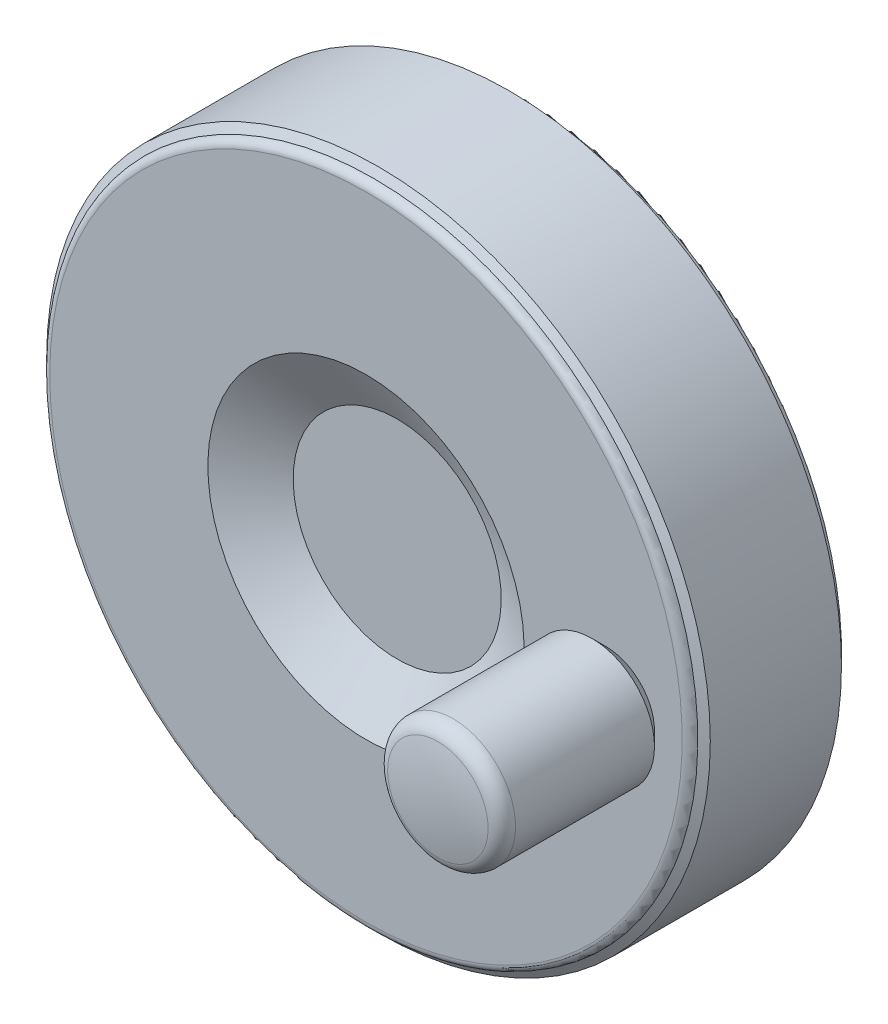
ISO-10303-21;
HEADER;
FILE_DESCRIPTION(('STEP AP214'),'2;1');
FILE_NAME('part.step','',(''),(''),'','','');
FILE_SCHEMA(('AUTOMOTIVE_DESIGN { 1 0 10303 214 1 1 1 1 }'));
ENDSEC;
DATA;
#1=APPLICATION_CONTEXT('core data for automotive mechanical design processes');
#2=APPLICATION_PROTOCOL_DEFINITION('international standard','automotive_design',2000,#1);
#3=PRODUCT_CONTEXT('',#1,'mechanical');
#4=PRODUCT('Part','Part','',(#3));
#5=PRODUCT_RELATED_PRODUCT_CATEGORY('part','',(#4));
#6=PRODUCT_DEFINITION_FORMATION('','',#4);
#7=PRODUCT_DEFINITION_CONTEXT('part definition',#1,'design');
#8=PRODUCT_DEFINITION('design','',#6,#7);
#9=PRODUCT_DEFINITION_SHAPE('','',#8);
#10=(LENGTH_UNIT() NAMED_UNIT(*) SI_UNIT(.MILLI.,.METRE.));
#11=(NAMED_UNIT(*) PLANE_ANGLE_UNIT() SI_UNIT($,.RADIAN.));
#12=(NAMED_UNIT(*) SI_UNIT($,.STERADIAN.) SOLID_ANGLE_UNIT());
#13=UNCERTAINTY_MEASURE_WITH_UNIT(LENGTH_MEASURE(1.E-05),#10,'distance_accuracy_value','');
#14=(GEOMETRIC_REPRESENTATION_CONTEXT(3) GLOBAL_UNCERTAINTY_ASSIGNED_CONTEXT((#13)) GLOBAL_UNIT_ASSIGNED_CONTEXT((#10,
#11,#12)) REPRESENTATION_CONTEXT('',''));
#15=CARTESIAN_POINT('',(0.,0.,0.));
#16=DIRECTION('',(0.,0.,1.));
#17=DIRECTION('',(1.,0.,0.));
#18=AXIS2_PLACEMENT_3D('',#15,#16,#17);
#19=CARTESIAN_POINT('',(-14.5,0.,7.44337567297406));
#20=DIRECTION('',(0.,0.5,0.866025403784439));
#21=DIRECTION('',(0.,0.866025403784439,-0.5));
#22=AXIS2_PLACEMENT_3D('',#19,#20,#21);
#23=PLANE('',#22);
#24=DIRECTION('',(-1.,0.,0.));
#25=VECTOR('',#24,1.);
#26=CARTESIAN_POINT('',(-14.5,0.,7.44337567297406));
#27=LINE('',#26,#25);
#28=CARTESIAN_POINT('',(-11.3333333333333,0.,7.44337567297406));
#29=VERTEX_POINT('',#28);
#30=CARTESIAN_POINT('',(-14.5,0.,7.44337567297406));
#31=VERTEX_POINT('',#30);
#32=EDGE_CURVE('E98',#29,#31,#27,.T.);
#33=ORIENTED_EDGE('',*,*,#32,.T.);
#34=DIRECTION('',(0.,0.866025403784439,-0.5));
#35=VECTOR('',#34,1.);
#36=CARTESIAN_POINT('',(-14.5,0.,7.44337567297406));
#37=LINE('',#36,#35);
#38=CARTESIAN_POINT('',(-14.5,1.25,6.72168783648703));
#39=VERTEX_POINT('',#38);
#40=EDGE_CURVE('E87',#39,#31,#37,.F.);
#41=ORIENTED_EDGE('',*,*,#40,.F.);
#42=DIRECTION('',(-1.,0.,0.));
#43=VECTOR('',#42,1.);
#44=CARTESIAN_POINT('',(-14.5,1.25,6.72168783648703));
#45=LINE('',#44,#43);
#46=CARTESIAN_POINT('',(-11.3333333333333,1.25,6.72168783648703));
#47=VERTEX_POINT('',#46);
#48=EDGE_CURVE('E302',#39,#47,#45,.F.);
#49=ORIENTED_EDGE('',*,*,#48,.T.);
#50=DIRECTION('',(0.,0.866025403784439,-0.5));
#51=VECTOR('',#50,1.);
#52=CARTESIAN_POINT('',(-11.3333333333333,0.,7.44337567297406));
#53=LINE('',#52,#51);
#54=EDGE_CURVE('E82',#29,#47,#53,.T.);
#55=ORIENTED_EDGE('',*,*,#54,.F.);
#56=EDGE_LOOP('',(#33,#41,#49,#55));
#57=FACE_BOUND('',#56,.T.);
#58=ADVANCED_FACE('F15',(#57),#23,.F.);
#59=CARTESIAN_POINT('',(-14.5,-1.25,6.72168783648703));
#60=DIRECTION('',(0.,-0.5,0.866025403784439));
#61=DIRECTION('',(0.,0.866025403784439,0.5));
#62=AXIS2_PLACEMENT_3D('',#59,#60,#61);
#63=PLANE('',#62);
#64=DIRECTION('',(1.,0.,0.));
#65=VECTOR('',#64,1.);
#66=CARTESIAN_POINT('',(-14.5,-1.25,6.72168783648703));
#67=LINE('',#66,#65);
#68=CARTESIAN_POINT('',(-11.3333333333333,-1.25,6.72168783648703));
#69=VERTEX_POINT('',#68);
#70=CARTESIAN_POINT('',(-14.5,-1.25,6.72168783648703));
#71=VERTEX_POINT('',#70);
#72=EDGE_CURVE('E103',#69,#71,#67,.F.);
#73=ORIENTED_EDGE('',*,*,#72,.T.);
#74=DIRECTION('',(0.,0.866025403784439,0.5));
#75=VECTOR('',#74,1.);
#76=CARTESIAN_POINT('',(-14.5,-1.25,6.72168783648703));
#77=LINE('',#76,#75);
#78=EDGE_CURVE('E90',#31,#71,#77,.F.);
#79=ORIENTED_EDGE('',*,*,#78,.F.);
#80=ORIENTED_EDGE('',*,*,#32,.F.);
#81=DIRECTION('',(0.,0.866025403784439,0.5));
#82=VECTOR('',#81,1.);
#83=CARTESIAN_POINT('',(-11.3333333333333,-1.25,6.72168783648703));
#84=LINE('',#83,#82);
#85=EDGE_CURVE('E105',#69,#29,#84,.T.);
#86=ORIENTED_EDGE('',*,*,#85,.F.);
#87=EDGE_LOOP('',(#73,#79,#80,#86));
#88=FACE_BOUND('',#87,.T.);
#89=ADVANCED_FACE('F101',(#88),#63,.F.);
#90=CARTESIAN_POINT('',(-14.5,1.25,6.72168783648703));
#91=DIRECTION('',(0.,1.,0.));
#92=DIRECTION('',(-1.,0.,0.));
#93=AXIS2_PLACEMENT_3D('',#90,#91,#92);
#94=PLANE('',#93);
#95=ORIENTED_EDGE('',*,*,#48,.F.);
#96=DIRECTION('',(0.,0.,1.));
#97=VECTOR('',#96,1.);
#98=CARTESIAN_POINT('',(-14.5,1.25,6.72168783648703));
#99=LINE('',#98,#97);
#100=CARTESIAN_POINT('',(-14.5,1.25,5.27831216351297));
#101=VERTEX_POINT('',#100);
#102=EDGE_CURVE('E93',#101,#39,#99,.T.);
#103=ORIENTED_EDGE('',*,*,#102,.F.);
#104=DIRECTION('',(-1.,0.,0.));
#105=VECTOR('',#104,1.);
#106=CARTESIAN_POINT('',(-14.5,1.25,5.27831216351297));
#107=LINE('',#106,#105);
#108=CARTESIAN_POINT('',(-11.3333333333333,1.25,5.27831216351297));
#109=VERTEX_POINT('',#108);
#110=EDGE_CURVE('E292',#101,#109,#107,.F.);
#111=ORIENTED_EDGE('',*,*,#110,.T.);
#112=DIRECTION('',(0.,0.,1.));
#113=VECTOR('',#112,1.);
#114=CARTESIAN_POINT('',(-11.3333333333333,1.25,6.72168783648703));
#115=LINE('',#114,#113);
#116=EDGE_CURVE('E300',#47,#109,#115,.F.);
#117=ORIENTED_EDGE('',*,*,#116,.F.);
#118=EDGE_LOOP('',(#95,#103,#111,#117));
#119=FACE_BOUND('',#118,.T.);
#120=ADVANCED_FACE('F305',(#119),#94,.F.);
#121=CARTESIAN_POINT('',(-14.5,-1.25,5.27831216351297));
#122=DIRECTION('',(0.,-1.,0.));
#123=DIRECTION('',(1.,0.,0.));
#124=AXIS2_PLACEMENT_3D('',#121,#122,#123);
#125=PLANE('',#124);
#126=DIRECTION('',(-1.,0.,0.));
#127=VECTOR('',#126,1.);
#128=CARTESIAN_POINT('',(-14.5,-1.25,5.27831216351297));
#129=LINE('',#128,#127);
#130=CARTESIAN_POINT('',(-11.3333333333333,-1.25,5.27831216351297));
#131=VERTEX_POINT('',#130);
#132=CARTESIAN_POINT('',(-14.5,-1.25,5.27831216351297));
#133=VERTEX_POINT('',#132);
#134=EDGE_CURVE('E283',#131,#133,#129,.T.);
#135=ORIENTED_EDGE('',*,*,#134,.T.);
#136=DIRECTION('',(0.,0.,1.));
#137=VECTOR('',#136,1.);
#138=CARTESIAN_POINT('',(-14.5,-1.25,5.27831216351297));
#139=LINE('',#138,#137);
#140=EDGE_CURVE('E297',#71,#133,#139,.F.);
#141=ORIENTED_EDGE('',*,*,#140,.F.);
#142=ORIENTED_EDGE('',*,*,#72,.F.);
#143=DIRECTION('',(0.,0.,1.));
#144=VECTOR('',#143,1.);
#145=CARTESIAN_POINT('',(-11.3333333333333,-1.25,0.));
#146=LINE('',#145,#144);
#147=EDGE_CURVE('E286',#131,#69,#146,.T.);
#148=ORIENTED_EDGE('',*,*,#147,.F.);
#149=EDGE_LOOP('',(#135,#141,#142,#148));
#150=FACE_BOUND('',#149,.T.);
#151=ADVANCED_FACE('F312',(#150),#125,.F.);
#152=CARTESIAN_POINT('',(-14.5,1.25,5.27831216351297));
#153=DIRECTION('',(0.,0.5,-0.866025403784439));
#154=DIRECTION('',(0.,-0.866025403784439,-0.5));
#155=AXIS2_PLACEMENT_3D('',#152,#153,#154);
#156=PLANE('',#155);
#157=ORIENTED_EDGE('',*,*,#110,.F.);
#158=DIRECTION('',(0.,-0.866025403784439,-0.5));
#159=VECTOR('',#158,1.);
#160=CARTESIAN_POINT('',(-14.5,1.25,5.27831216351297));
#161=LINE('',#160,#159);
#162=CARTESIAN_POINT('',(-14.5,0.,4.55662432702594));
#163=VERTEX_POINT('',#162);
#164=EDGE_CURVE('E295',#163,#101,#161,.F.);
#165=ORIENTED_EDGE('',*,*,#164,.F.);
#166=DIRECTION('',(-1.,0.,0.));
#167=VECTOR('',#166,1.);
#168=CARTESIAN_POINT('',(-14.5,0.,4.55662432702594));
#169=LINE('',#168,#167);
#170=CARTESIAN_POINT('',(-11.3333333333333,0.,4.55662432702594));
#171=VERTEX_POINT('',#170);
#172=EDGE_CURVE('E281',#163,#171,#169,.F.);
#173=ORIENTED_EDGE('',*,*,#172,.T.);
#174=DIRECTION('',(0.,-0.866025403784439,-0.5));
#175=VECTOR('',#174,1.);
#176=CARTESIAN_POINT('',(-11.3333333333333,1.25,5.27831216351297));
#177=LINE('',#176,#175);
#178=EDGE_CURVE('E289',#109,#171,#177,.T.);
#179=ORIENTED_EDGE('',*,*,#178,.F.);
#180=EDGE_LOOP('',(#157,#165,#173,#179));
#181=FACE_BOUND('',#180,.T.);
#182=ADVANCED_FACE('F319',(#181),#156,.F.);
#183=CARTESIAN_POINT('',(-11.3333333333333,0.,0.));
#184=DIRECTION('',(-1.,0.,0.));
#185=DIRECTION('',(0.,-1.,0.));
#186=AXIS2_PLACEMENT_3D('',#183,#184,#185);
#187=PLANE('',#186);
#188=ORIENTED_EDGE('',*,*,#54,.T.);
#189=ORIENTED_EDGE('',*,*,#116,.T.);
#190=ORIENTED_EDGE('',*,*,#178,.T.);
#191=DIRECTION('',(0.,-0.866025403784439,0.5));
#192=VECTOR('',#191,1.);
#193=CARTESIAN_POINT('',(-11.3333333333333,0.,4.55662432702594));
#194=LINE('',#193,#192);
#195=EDGE_CURVE('E278',#171,#131,#194,.T.);
#196=ORIENTED_EDGE('',*,*,#195,.T.);
#197=ORIENTED_EDGE('',*,*,#147,.T.);
#198=ORIENTED_EDGE('',*,*,#85,.T.);
#199=EDGE_LOOP('',(#188,#189,#190,#196,#197,#198));
#200=FACE_BOUND('',#199,.T.);
#201=ADVANCED_FACE('F309',(#200),#187,.T.);
#202=CARTESIAN_POINT('',(-14.5,0.,4.55662432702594));
#203=DIRECTION('',(0.,-0.5,-0.866025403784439));
#204=DIRECTION('',(0.,-0.866025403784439,0.5));
#205=AXIS2_PLACEMENT_3D('',#202,#203,#204);
#206=PLANE('',#205);
#207=ORIENTED_EDGE('',*,*,#172,.F.);
#208=DIRECTION('',(0.,0.866025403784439,-0.5));
#209=VECTOR('',#208,1.);
#210=CARTESIAN_POINT('',(-14.5,-1.25,5.27831216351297));
#211=LINE('',#210,#209);
#212=EDGE_CURVE('E274',#133,#163,#211,.T.);
#213=ORIENTED_EDGE('',*,*,#212,.F.);
#214=ORIENTED_EDGE('',*,*,#134,.F.);
#215=ORIENTED_EDGE('',*,*,#195,.F.);
#216=EDGE_LOOP('',(#207,#213,#214,#215));
#217=FACE_BOUND('',#216,.T.);
#218=ADVANCED_FACE('F317',(#217),#206,.F.);
#219=CARTESIAN_POINT('',(-14.5,0.,7.00475));
#220=DIRECTION('',(-1.,0.,0.));
#221=DIRECTION('',(0.,-1.,0.));
#222=AXIS2_PLACEMENT_3D('',#219,#220,#221);
#223=PLANE('',#222);
#224=CARTESIAN_POINT('',(-14.4999999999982,0.,6.));
#225=DIRECTION('',(1.,0.,0.));
#226=DIRECTION('',(0.,1.,0.));
#227=AXIS2_PLACEMENT_3D('',#224,#225,#226);
#228=CIRCLE('',#227,2.00950000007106);
#229=CARTESIAN_POINT('',(-14.4999999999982,2.00950000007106,6.));
#230=VERTEX_POINT('',#229);
#231=EDGE_CURVE('E277',#230,#230,#228,.T.);
#232=ORIENTED_EDGE('',*,*,#231,.F.);
#233=EDGE_LOOP('',(#232));
#234=FACE_BOUND('',#233,.T.);
#235=ORIENTED_EDGE('',*,*,#140,.T.);
#236=ORIENTED_EDGE('',*,*,#212,.T.);
#237=ORIENTED_EDGE('',*,*,#164,.T.);
#238=ORIENTED_EDGE('',*,*,#102,.T.);
#239=ORIENTED_EDGE('',*,*,#40,.T.);
#240=ORIENTED_EDGE('',*,*,#78,.T.);
#241=EDGE_LOOP('',(#235,#236,#237,#238,#239,#240));
#242=FACE_BOUND('',#241,.T.);
#243=ADVANCED_FACE('F88',(#234,#242),#223,.T.);
#244=CARTESIAN_POINT('',(0.,0.,11.5));
#245=DIRECTION('',(0.,0.,-1.));
#246=DIRECTION('',(-1.,0.,0.));
#247=AXIS2_PLACEMENT_3D('',#244,#245,#246);
#248=CYLINDRICAL_SURFACE('',#247,5.00000000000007);
#249=CARTESIAN_POINT('',(0.,0.,22.));
#250=DIRECTION('',(0.,0.,-1.));
#251=DIRECTION('',(0.,-1.,0.));
#252=AXIS2_PLACEMENT_3D('',#249,#250,#251);
#253=CIRCLE('',#252,5.00000000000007);
#254=CARTESIAN_POINT('',(0.,-5.00000000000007,22.));
#255=VERTEX_POINT('',#254);
#256=EDGE_CURVE('E95',#255,#255,#253,.T.);
#257=ORIENTED_EDGE('',*,*,#256,.F.);
#258=EDGE_LOOP('',(#257));
#259=FACE_BOUND('',#258,.T.);
#260=CARTESIAN_POINT('',(0.,0.,0.));
#261=DIRECTION('',(0.,0.,-1.));
#262=DIRECTION('',(-1.,0.,0.));
#263=AXIS2_PLACEMENT_3D('',#260,#261,#262);
#264=CIRCLE('',#263,5.00000000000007);
#265=CARTESIAN_POINT('',(-5.00000000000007,0.,0.));
#266=VERTEX_POINT('',#265);
#267=EDGE_CURVE('E273',#266,#266,#264,.F.);
#268=ORIENTED_EDGE('',*,*,#267,.F.);
#269=EDGE_LOOP('',(#268));
#270=FACE_BOUND('',#269,.T.);
#271=ADVANCED_FACE('F365',(#259,#270),#248,.F.);
#272=CARTESIAN_POINT('',(-14.0095000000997,0.,6.));
#273=DIRECTION('',(1.,0.,0.));
#274=DIRECTION('',(0.,1.,0.));
#275=AXIS2_PLACEMENT_3D('',#272,#273,#274);
#276=CONICAL_SURFACE('',#275,2.49999999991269,0.785398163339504);
#277=CARTESIAN_POINT('',(-14.0095,0.,6.));
#278=DIRECTION('',(-1.,0.,0.));
#279=DIRECTION('',(0.,-1.,0.));
#280=AXIS2_PLACEMENT_3D('',#277,#278,#279);
#281=CIRCLE('',#280,2.5);
#282=CARTESIAN_POINT('',(-14.0095,-2.5,6.));
#283=VERTEX_POINT('',#282);
#284=EDGE_CURVE('E270',#283,#283,#281,.F.);
#285=ORIENTED_EDGE('',*,*,#284,.F.);
#286=EDGE_LOOP('',(#285));
#287=FACE_BOUND('',#286,.T.);
#288=ORIENTED_EDGE('',*,*,#231,.T.);
#289=EDGE_LOOP('',(#288));
#290=FACE_BOUND('',#289,.T.);
#291=ADVANCED_FACE('F375',(#287,#290),#276,.T.);
#292=CARTESIAN_POINT('',(-6.5,0.,0.));
#293=DIRECTION('',(0.,0.,-1.));
#294=DIRECTION('',(-1.,0.,0.));
#295=AXIS2_PLACEMENT_3D('',#292,#293,#294);
#296=PLANE('',#295);
#297=ORIENTED_EDGE('',*,*,#267,.T.);
#298=EDGE_LOOP('',(#297));
#299=FACE_BOUND('',#298,.T.);
#300=CARTESIAN_POINT('',(0.,0.,0.));
#301=DIRECTION('',(0.,0.,-1.));
#302=DIRECTION('',(-1.,0.,0.));
#303=AXIS2_PLACEMENT_3D('',#300,#301,#302);
#304=CIRCLE('',#303,8.);
#305=CARTESIAN_POINT('',(-8.,0.,0.));
#306=VERTEX_POINT('',#305);
#307=EDGE_CURVE('E269',#306,#306,#304,.F.);
#308=ORIENTED_EDGE('',*,*,#307,.F.);
#309=EDGE_LOOP('',(#308));
#310=FACE_BOUND('',#309,.T.);
#311=ADVANCED_FACE('F385',(#299,#310),#296,.T.);
#312=CARTESIAN_POINT('',(-9.75,0.,6.));
#313=DIRECTION('',(-1.,0.,0.));
#314=DIRECTION('',(0.,-1.,0.));
#315=AXIS2_PLACEMENT_3D('',#312,#313,#314);
#316=CYLINDRICAL_SURFACE('',#315,2.5);
#317=CARTESIAN_POINT('',(-7.99999999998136,0.,6.));
#318=DIRECTION('',(-1.,0.,0.));
#319=DIRECTION('',(0.,0.,1.));
#320=AXIS2_PLACEMENT_3D('',#317,#318,#319);
#321=CIRCLE('',#320,2.49999999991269);
#322=CARTESIAN_POINT('',(-7.99999999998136,0.,8.49999999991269));
#323=VERTEX_POINT('',#322);
#324=EDGE_CURVE('E266',#323,#323,#321,.T.);
#325=ORIENTED_EDGE('',*,*,#324,.T.);
#326=EDGE_LOOP('',(#325));
#327=FACE_BOUND('',#326,.T.);
#328=ORIENTED_EDGE('',*,*,#284,.T.);
#329=EDGE_LOOP('',(#328));
#330=FACE_BOUND('',#329,.T.);
#331=ADVANCED_FACE('F395',(#327,#330),#316,.T.);
#332=CARTESIAN_POINT('',(0.,0.,0.15));
#333=DIRECTION('',(0.,0.,-1.));
#334=DIRECTION('',(-1.,0.,0.));
#335=AXIS2_PLACEMENT_3D('',#332,#333,#334);
#336=CYLINDRICAL_SURFACE('',#335,8.);
#337=CARTESIAN_POINT('',(0.,0.,0.3));
#338=DIRECTION('',(0.,0.,-1.));
#339=DIRECTION('',(-1.,0.,0.));
#340=AXIS2_PLACEMENT_3D('',#337,#338,#339);
#341=CIRCLE('',#340,8.);
#342=CARTESIAN_POINT('',(-8.,0.,0.3));
#343=VERTEX_POINT('',#342);
#344=EDGE_CURVE('E265',#343,#343,#341,.F.);
#345=ORIENTED_EDGE('',*,*,#344,.F.);
#346=EDGE_LOOP('',(#345));
#347=FACE_BOUND('',#346,.T.);
#348=ORIENTED_EDGE('',*,*,#307,.T.);
#349=EDGE_LOOP('',(#348));
#350=FACE_BOUND('',#349,.T.);
#351=ADVANCED_FACE('F405',(#347,#350),#336,.T.);
#352=CARTESIAN_POINT('',(-8.27777777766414,0.,6.));
#353=DIRECTION('',(-1.,0.,0.));
#354=DIRECTION('',(0.,-1.,0.));
#355=AXIS2_PLACEMENT_3D('',#352,#353,#354);
#356=CONICAL_SURFACE('',#355,2.77777777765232,0.785398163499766);
#357=CARTESIAN_POINT('',(-8.27777777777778,0.,6.));
#358=DIRECTION('',(-1.,0.,0.));
#359=DIRECTION('',(0.,-1.,0.));
#360=AXIS2_PLACEMENT_3D('',#357,#358,#359);
#361=CIRCLE('',#360,2.77777777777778);
#362=CARTESIAN_POINT('',(-8.27777777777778,-2.77777777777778,6.));
#363=VERTEX_POINT('',#362);
#364=EDGE_CURVE('E262',#363,#363,#361,.T.);
#365=ORIENTED_EDGE('',*,*,#364,.T.);
#366=EDGE_LOOP('',(#365));
#367=FACE_BOUND('',#366,.T.);
#368=ORIENTED_EDGE('',*,*,#324,.F.);
#369=EDGE_LOOP('',(#368));
#370=FACE_BOUND('',#369,.T.);
#371=ADVANCED_FACE('F415',(#367,#370),#356,.F.);
#372=CARTESIAN_POINT('',(-10.5,0.,0.3));
#373=DIRECTION('',(0.,0.,-1.));
#374=DIRECTION('',(-1.,0.,0.));
#375=AXIS2_PLACEMENT_3D('',#372,#373,#374);
#376=PLANE('',#375);
#377=ORIENTED_EDGE('',*,*,#344,.T.);
#378=EDGE_LOOP('',(#377));
#379=FACE_BOUND('',#378,.T.);
#380=CARTESIAN_POINT('',(0.,0.,0.3));
#381=DIRECTION('',(0.,0.,1.));
#382=DIRECTION('',(1.,0.,0.));
#383=AXIS2_PLACEMENT_3D('',#380,#381,#382);
#384=CIRCLE('',#383,13.);
#385=CARTESIAN_POINT('',(13.,0.,0.3));
#386=VERTEX_POINT('',#385);
#387=EDGE_CURVE('E156',#386,#386,#384,.T.);
#388=ORIENTED_EDGE('',*,*,#387,.F.);
#389=EDGE_LOOP('',(#388));
#390=FACE_BOUND('',#389,.T.);
#391=ADVANCED_FACE('F177',(#379,#390),#376,.T.);
#392=CARTESIAN_POINT('',(-11.3888888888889,0.,6.));
#393=DIRECTION('',(-1.,0.,0.));
#394=DIRECTION('',(0.,-1.,0.));
#395=AXIS2_PLACEMENT_3D('',#392,#393,#394);
#396=CYLINDRICAL_SURFACE('',#395,2.77777777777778);
#397=CARTESIAN_POINT('',(-14.5,0.,3.22222222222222));
#398=CARTESIAN_POINT('',(-14.4999965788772,0.154356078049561,3.222229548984));
#399=CARTESIAN_POINT('',(-14.4975075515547,0.308905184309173,3.23514331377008));
#400=CARTESIAN_POINT('',(-14.4878107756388,0.613765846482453,3.28645582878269));
#401=CARTESIAN_POINT('',(-14.4805936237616,0.76406833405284,3.32490536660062));
#402=CARTESIAN_POINT('',(-14.4622478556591,1.05580175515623,3.42606896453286));
#403=CARTESIAN_POINT('',(-14.4511245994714,1.19724453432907,3.48874978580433));
#404=CARTESIAN_POINT('',(-14.4261824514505,1.46755141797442,3.63651329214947));
#405=CARTESIAN_POINT('',(-14.4123644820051,1.59641980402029,3.72158831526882));
#406=CARTESIAN_POINT('',(-14.3833600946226,1.83960238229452,3.91287025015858));
#407=CARTESIAN_POINT('',(-14.36815999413,1.95373592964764,4.01930478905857));
#408=CARTESIAN_POINT('',(-14.3382048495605,2.1626481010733,4.24979987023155));
#409=CARTESIAN_POINT('',(-14.3234498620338,2.25742427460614,4.37386264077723));
#410=CARTESIAN_POINT('',(-14.2959248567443,2.42567209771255,4.63735709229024));
#411=CARTESIAN_POINT('',(-14.2831722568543,2.49896114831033,4.77690734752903));
#412=CARTESIAN_POINT('',(-14.261287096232,2.62098419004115,5.06662395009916));
#413=CARTESIAN_POINT('',(-14.2521541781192,2.66972060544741,5.21678924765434));
#414=CARTESIAN_POINT('',(-14.2386789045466,2.74067957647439,5.52155667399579));
#415=CARTESIAN_POINT('',(-14.2342801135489,2.7632147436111,5.67608347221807));
#416=CARTESIAN_POINT('',(-14.2306010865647,2.78210205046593,5.98678274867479));
#417=CARTESIAN_POINT('',(-14.2313203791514,2.77845660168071,6.14295507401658));
#418=CARTESIAN_POINT('',(-14.2377448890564,2.74533947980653,6.45023869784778));
#419=CARTESIAN_POINT('',(-14.2433812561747,2.71622442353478,6.60139008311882));
#420=CARTESIAN_POINT('',(-14.2588966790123,2.63355618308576,6.89662359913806));
#421=CARTESIAN_POINT('',(-14.2687759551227,2.58000172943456,7.04070536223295));
#422=CARTESIAN_POINT('',(-14.2917358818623,2.44962683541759,7.31875113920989));
#423=CARTESIAN_POINT('',(-14.3048362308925,2.37266251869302,7.45264599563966));
#424=CARTESIAN_POINT('',(-14.3327480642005,2.19776041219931,7.70574469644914));
#425=CARTESIAN_POINT('',(-14.3475596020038,2.09982196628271,7.82494808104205));
#426=CARTESIAN_POINT('',(-14.3775224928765,1.88385233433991,8.04733068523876));
#427=CARTESIAN_POINT('',(-14.3926754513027,1.76551985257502,8.15021726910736));
#428=CARTESIAN_POINT('',(-14.4213994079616,1.51306062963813,8.33476963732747));
#429=CARTESIAN_POINT('',(-14.4349697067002,1.37892695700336,8.41642605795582));
#430=CARTESIAN_POINT('',(-14.4590300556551,1.09832511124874,8.55624122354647));
#431=CARTESIAN_POINT('',(-14.4695134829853,0.951831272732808,8.6143495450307));
#432=CARTESIAN_POINT('',(-14.4861525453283,0.651105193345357,8.70493541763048));
#433=CARTESIAN_POINT('',(-14.4923172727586,0.496889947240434,8.73746683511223));
#434=CARTESIAN_POINT('',(-14.497318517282,0.284596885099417,8.76375109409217));
#435=CARTESIAN_POINT('',(-14.4983218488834,0.227817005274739,8.76900666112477));
#436=CARTESIAN_POINT('',(-14.4996632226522,0.114033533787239,8.77602135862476));
#437=CARTESIAN_POINT('',(-14.5000012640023,0.0570299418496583,8.77778048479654));
#438=CARTESIAN_POINT('',(-14.4999965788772,-0.15435607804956,8.77777045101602));
#439=CARTESIAN_POINT('',(-14.4975075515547,-0.308905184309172,8.76485668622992));
#440=CARTESIAN_POINT('',(-14.4878107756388,-0.613765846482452,8.71354417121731));
#441=CARTESIAN_POINT('',(-14.4805936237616,-0.764068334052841,8.67509463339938));
#442=CARTESIAN_POINT('',(-14.4622478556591,-1.05580175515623,8.57393103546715));
#443=CARTESIAN_POINT('',(-14.4511245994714,-1.19724453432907,8.51125021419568));
#444=CARTESIAN_POINT('',(-14.4261824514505,-1.46755141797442,8.36348670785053));
#445=CARTESIAN_POINT('',(-14.4123644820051,-1.59641980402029,8.27841168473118));
#446=CARTESIAN_POINT('',(-14.3833600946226,-1.83960238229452,8.08712974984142));
#447=CARTESIAN_POINT('',(-14.36815999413,-1.95373592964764,7.98069521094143));
#448=CARTESIAN_POINT('',(-14.3382048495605,-2.1626481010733,7.75020012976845));
#449=CARTESIAN_POINT('',(-14.3234498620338,-2.25742427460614,7.62613735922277));
#450=CARTESIAN_POINT('',(-14.2959248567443,-2.42567209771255,7.36264290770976));
#451=CARTESIAN_POINT('',(-14.2831722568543,-2.49896114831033,7.22309265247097));
#452=CARTESIAN_POINT('',(-14.261287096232,-2.62098419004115,6.93337604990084));
#453=CARTESIAN_POINT('',(-14.2521541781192,-2.66972060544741,6.78321075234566));
#454=CARTESIAN_POINT('',(-14.2386789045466,-2.74067957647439,6.47844332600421));
#455=CARTESIAN_POINT('',(-14.2342801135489,-2.7632147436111,6.32391652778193));
#456=CARTESIAN_POINT('',(-14.2306010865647,-2.78210205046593,6.01321725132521));
#457=CARTESIAN_POINT('',(-14.2313203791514,-2.77845660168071,5.85704492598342));
#458=CARTESIAN_POINT('',(-14.2377448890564,-2.74533947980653,5.54976130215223));
#459=CARTESIAN_POINT('',(-14.2433812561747,-2.71622442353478,5.39860991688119));
#460=CARTESIAN_POINT('',(-14.2588966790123,-2.63355618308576,5.10337640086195));
#461=CARTESIAN_POINT('',(-14.2687759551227,-2.58000172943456,4.95929463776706));
#462=CARTESIAN_POINT('',(-14.2917358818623,-2.44962683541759,4.68124886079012));
#463=CARTESIAN_POINT('',(-14.3048362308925,-2.37266251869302,4.54735400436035));
#464=CARTESIAN_POINT('',(-14.3327480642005,-2.19776041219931,4.29425530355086));
#465=CARTESIAN_POINT('',(-14.3475596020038,-2.09982196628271,4.17505191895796));
#466=CARTESIAN_POINT('',(-14.3775224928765,-1.88385233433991,3.95266931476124));
#467=CARTESIAN_POINT('',(-14.3926754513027,-1.76551985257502,3.84978273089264));
#468=CARTESIAN_POINT('',(-14.4213994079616,-1.51306062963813,3.66523036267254));
#469=CARTESIAN_POINT('',(-14.4349697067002,-1.37892695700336,3.58357394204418));
#470=CARTESIAN_POINT('',(-14.4590300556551,-1.09832511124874,3.44375877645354));
#471=CARTESIAN_POINT('',(-14.4695134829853,-0.951831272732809,3.3856504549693));
#472=CARTESIAN_POINT('',(-14.4861525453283,-0.651105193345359,3.29506458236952));
#473=CARTESIAN_POINT('',(-14.4923172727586,-0.496889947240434,3.26253316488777));
#474=CARTESIAN_POINT('',(-14.497318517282,-0.284596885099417,3.23624890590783));
#475=CARTESIAN_POINT('',(-14.4983218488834,-0.22781700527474,3.23099333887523));
#476=CARTESIAN_POINT('',(-14.4996632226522,-0.11403353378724,3.22397864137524));
#477=CARTESIAN_POINT('',(-14.5000012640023,-0.0570299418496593,3.22221951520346));
#478=CARTESIAN_POINT('',(-14.5,0.,3.22222222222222));
#479=B_SPLINE_CURVE_WITH_KNOTS('',3,(#397,#398,#399,#400,#401,#402,#403,#404,#405,#406,#407,
#408,#409,#410,#411,#412,#413,#414,#415,#416,#417,#418,#419,#420,#421,#422,#423,#424,#425,#426,
#427,#428,#429,#430,#431,#432,#433,#434,#435,#436,#437,#438,#439,#440,#441,#442,#443,#444,#445,
#446,#447,#448,#449,#450,#451,#452,#453,#454,#455,#456,#457,#458,#459,#460,#461,#462,#463,#464,
#465,#466,#467,#468,#469,#470,#471,#472,#473,#474,#475,#476,#477,#478),.UNSPECIFIED.,.T.,.F.,(4,
2,2,2,2,2,2,2,2,2,2,2,2,2,2,2,2,2,2,2,2,2,2,2,2,2,2,2,2,2,2,2,2,2,2,2,2,2,2,2,4),(0.,
0.462850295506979,0.926623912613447,1.38976360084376,1.85274503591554,2.32095093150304,
2.78921606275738,3.26135228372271,3.73344187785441,4.1998391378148,4.6661934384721,
5.12612067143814,5.58607179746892,6.04890893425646,6.5117605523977,6.98215132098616,
7.45274920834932,7.92434952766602,8.39495395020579,8.56596304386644,8.73697234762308,
9.19982264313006,9.66359626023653,10.1267359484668,10.5897173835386,11.0579232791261,
11.5261884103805,11.9983246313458,12.4704142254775,12.9368114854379,13.4031657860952,
13.8630930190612,14.323044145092,14.7858812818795,15.2487329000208,15.7191236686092,
16.1897215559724,16.6613218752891,17.1319262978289,17.3029353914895,17.4739446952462),.UNSPECIFIED.);
#480=CARTESIAN_POINT('',(-14.5,0.,3.22222222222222));
#481=VERTEX_POINT('',#480);
#482=EDGE_CURVE('E147',#481,#481,#479,.T.);
#483=ORIENTED_EDGE('',*,*,#482,.F.);
#484=EDGE_LOOP('',(#483));
#485=FACE_BOUND('',#484,.T.);
#486=ORIENTED_EDGE('',*,*,#364,.F.);
#487=EDGE_LOOP('',(#486));
#488=FACE_BOUND('',#487,.T.);
#489=ADVANCED_FACE('F158',(#485,#488),#396,.F.);
#490=CARTESIAN_POINT('',(0.,0.,1.8));
#491=DIRECTION('',(0.,0.,1.));
#492=DIRECTION('',(1.,0.,0.));
#493=AXIS2_PLACEMENT_3D('',#490,#491,#492);
#494=CONICAL_SURFACE('',#493,14.5,0.785398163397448);
#495=CARTESIAN_POINT('',(0.,0.,1.8));
#496=DIRECTION('',(0.,0.,-1.));
#497=DIRECTION('',(-1.,0.,0.));
#498=AXIS2_PLACEMENT_3D('',#495,#496,#497);
#499=CIRCLE('',#498,14.5);
#500=CARTESIAN_POINT('',(-14.5,0.,1.8));
#501=VERTEX_POINT('',#500);
#502=EDGE_CURVE('E155',#501,#501,#499,.F.);
#503=ORIENTED_EDGE('',*,*,#502,.F.);
#504=EDGE_LOOP('',(#503));
#505=FACE_BOUND('',#504,.T.);
#506=ORIENTED_EDGE('',*,*,#387,.T.);
#507=EDGE_LOOP('',(#506));
#508=FACE_BOUND('',#507,.T.);
#509=ADVANCED_FACE('F167',(#505,#508),#494,.T.);
#510=CARTESIAN_POINT('',(0.,0.,13.65));
#511=DIRECTION('',(0.,0.,-1.));
#512=DIRECTION('',(-1.,0.,0.));
#513=AXIS2_PLACEMENT_3D('',#510,#511,#512);
#514=CYLINDRICAL_SURFACE('',#513,14.5);
#515=ORIENTED_EDGE('',*,*,#482,.T.);
#516=EDGE_LOOP('',(#515));
#517=FACE_BOUND('',#516,.T.);
#518=CARTESIAN_POINT('',(0.,0.,25.5));
#519=DIRECTION('',(0.,0.,1.));
#520=DIRECTION('',(-1.,0.,0.));
#521=AXIS2_PLACEMENT_3D('',#518,#519,#520);
#522=CIRCLE('',#521,14.5);
#523=CARTESIAN_POINT('',(-14.5,0.,25.5));
#524=VERTEX_POINT('',#523);
#525=EDGE_CURVE('E146',#524,#524,#522,.T.);
#526=ORIENTED_EDGE('',*,*,#525,.F.);
#527=EDGE_LOOP('',(#526));
#528=FACE_BOUND('',#527,.T.);
#529=ORIENTED_EDGE('',*,*,#502,.T.);
#530=EDGE_LOOP('',(#529));
#531=FACE_BOUND('',#530,.T.);
#532=ADVANCED_FACE('F162',(#517,#528,#531),#514,.T.);
#533=CARTESIAN_POINT('',(0.,0.,26.5));
#534=DIRECTION('',(0.,0.,1.));
#535=DIRECTION('',(1.,0.,0.));
#536=AXIS2_PLACEMENT_3D('',#533,#534,#535);
#537=CONICAL_SURFACE('',#536,15.5,0.785398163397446);
#538=CARTESIAN_POINT('',(0.,0.,26.5));
#539=DIRECTION('',(0.,0.,1.));
#540=DIRECTION('',(1.,0.,0.));
#541=AXIS2_PLACEMENT_3D('',#538,#539,#540);
#542=CIRCLE('',#541,15.5);
#543=CARTESIAN_POINT('',(15.5,0.,26.5));
#544=VERTEX_POINT('',#543);
#545=EDGE_CURVE('E143',#544,#544,#542,.T.);
#546=ORIENTED_EDGE('',*,*,#545,.F.);
#547=EDGE_LOOP('',(#546));
#548=FACE_BOUND('',#547,.T.);
#549=ORIENTED_EDGE('',*,*,#525,.T.);
#550=EDGE_LOOP('',(#549));
#551=FACE_BOUND('',#550,.T.);
#552=ADVANCED_FACE('F166',(#548,#551),#537,.T.);
#553=CARTESIAN_POINT('',(-26.5,0.,26.5));
#554=DIRECTION('',(0.,0.,-1.));
#555=DIRECTION('',(-1.,0.,0.));
#556=AXIS2_PLACEMENT_3D('',#553,#554,#555);
#557=PLANE('',#556);
#558=ORIENTED_EDGE('',*,*,#545,.T.);
#559=EDGE_LOOP('',(#558));
#560=FACE_BOUND('',#559,.T.);
#561=CARTESIAN_POINT('',(0.,0.,26.5));
#562=DIRECTION('',(0.,0.,-1.));
#563=DIRECTION('',(0.,-1.,0.));
#564=AXIS2_PLACEMENT_3D('',#561,#562,#563);
#565=CIRCLE('',#564,37.5);
#566=CARTESIAN_POINT('',(0.,-37.5,26.5));
#567=VERTEX_POINT('',#566);
#568=EDGE_CURVE('E140',#567,#567,#565,.T.);
#569=ORIENTED_EDGE('',*,*,#568,.T.);
#570=EDGE_LOOP('',(#569));
#571=FACE_BOUND('',#570,.T.);
#572=ADVANCED_FACE('F443',(#560,#571),#557,.T.);
#573=CARTESIAN_POINT('',(0.,0.,25.5));
#574=DIRECTION('',(0.,0.,-1.));
#575=DIRECTION('',(0.,-1.,0.));
#576=AXIS2_PLACEMENT_3D('',#573,#574,#575);
#577=CONICAL_SURFACE('',#576,38.5,0.785398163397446);
#578=CARTESIAN_POINT('',(0.,0.,25.5));
#579=DIRECTION('',(0.,0.,-1.));
#580=DIRECTION('',(-1.,0.,0.));
#581=AXIS2_PLACEMENT_3D('',#578,#579,#580);
#582=CIRCLE('',#581,38.5);
#583=CARTESIAN_POINT('',(-38.5,0.,25.5));
#584=VERTEX_POINT('',#583);
#585=EDGE_CURVE('E139',#584,#584,#582,.T.);
#586=ORIENTED_EDGE('',*,*,#585,.T.);
#587=EDGE_LOOP('',(#586));
#588=FACE_BOUND('',#587,.T.);
#589=ORIENTED_EDGE('',*,*,#568,.F.);
#590=EDGE_LOOP('',(#589));
#591=FACE_BOUND('',#590,.T.);
#592=ADVANCED_FACE('F453',(#588,#591),#577,.F.);
#593=CARTESIAN_POINT('',(0.,0.,18.));
#594=DIRECTION('',(0.,0.,-1.));
#595=DIRECTION('',(-1.,0.,0.));
#596=AXIS2_PLACEMENT_3D('',#593,#594,#595);
#597=CYLINDRICAL_SURFACE('',#596,38.5);
#598=CARTESIAN_POINT('',(0.,0.,10.5));
#599=DIRECTION('',(0.,0.,-1.));
#600=DIRECTION('',(-1.,0.,0.));
#601=AXIS2_PLACEMENT_3D('',#598,#599,#600);
#602=CIRCLE('',#601,38.5);
#603=CARTESIAN_POINT('',(-38.5,0.,10.5));
#604=VERTEX_POINT('',#603);
#605=EDGE_CURVE('E135',#604,#604,#602,.F.);
#606=ORIENTED_EDGE('',*,*,#605,.F.);
#607=EDGE_LOOP('',(#606));
#608=FACE_BOUND('',#607,.T.);
#609=ORIENTED_EDGE('',*,*,#585,.F.);
#610=EDGE_LOOP('',(#609));
#611=FACE_BOUND('',#610,.T.);
#612=ADVANCED_FACE('F462',(#608,#611),#597,.F.);
#613=CARTESIAN_POINT('',(-39.5,0.,10.5));
#614=DIRECTION('',(0.,0.,-1.));
#615=DIRECTION('',(-1.,0.,0.));
#616=AXIS2_PLACEMENT_3D('',#613,#614,#615);
#617=PLANE('',#616);
#618=ORIENTED_EDGE('',*,*,#605,.T.);
#619=EDGE_LOOP('',(#618));
#620=FACE_BOUND('',#619,.T.);
#621=CARTESIAN_POINT('',(0.,0.,10.5));
#622=DIRECTION('',(0.,0.,1.));
#623=DIRECTION('',(0.,1.,0.));
#624=AXIS2_PLACEMENT_3D('',#621,#622,#623);
#625=CIRCLE('',#624,40.5);
#626=CARTESIAN_POINT('',(0.,40.5,10.5));
#627=VERTEX_POINT('',#626);
#628=CARTESIAN_POINT('',(-40.5,0.,10.5));
#629=VERTEX_POINT('',#628);
#630=EDGE_CURVE('E138',#627,#629,#625,.T.);
#631=ORIENTED_EDGE('',*,*,#630,.F.);
#632=CARTESIAN_POINT('',(0.,0.,10.5));
#633=DIRECTION('',(0.,0.,1.));
#634=DIRECTION('',(0.,-1.,0.));
#635=AXIS2_PLACEMENT_3D('',#632,#633,#634);
#636=CIRCLE('',#635,40.5);
#637=CARTESIAN_POINT('',(0.,-40.5,10.5));
#638=VERTEX_POINT('',#637);
#639=EDGE_CURVE('E238',#638,#627,#636,.T.);
#640=ORIENTED_EDGE('',*,*,#639,.F.);
#641=CARTESIAN_POINT('',(0.,0.,10.5));
#642=DIRECTION('',(0.,0.,1.));
#643=DIRECTION('',(-1.,0.,0.));
#644=AXIS2_PLACEMENT_3D('',#641,#642,#643);
#645=CIRCLE('',#644,40.5);
#646=EDGE_CURVE('E217',#629,#638,#645,.T.);
#647=ORIENTED_EDGE('',*,*,#646,.F.);
#648=EDGE_LOOP('',(#631,#640,#647));
#649=FACE_BOUND('',#648,.T.);
#650=ADVANCED_FACE('F195',(#620,#649),#617,.T.);
#651=CARTESIAN_POINT('',(0.,0.,11.5));
#652=DIRECTION('',(0.,0.,1.));
#653=DIRECTION('',(0.,1.,0.));
#654=AXIS2_PLACEMENT_3D('',#651,#652,#653);
#655=TOROIDAL_SURFACE('',#654,40.5,1.);
#656=CARTESIAN_POINT('',(0.,0.,11.5));
#657=DIRECTION('',(0.,0.,1.));
#658=DIRECTION('',(-1.,0.,0.));
#659=AXIS2_PLACEMENT_3D('',#656,#657,#658);
#660=CIRCLE('',#659,41.5);
#661=CARTESIAN_POINT('',(-41.5,0.,11.5));
#662=VERTEX_POINT('',#661);
#663=EDGE_CURVE('E212',#662,#662,#660,.T.);
#664=ORIENTED_EDGE('',*,*,#663,.F.);
#665=EDGE_LOOP('',(#664));
#666=FACE_BOUND('',#665,.T.);
#667=ORIENTED_EDGE('',*,*,#639,.T.);
#668=ORIENTED_EDGE('',*,*,#630,.T.);
#669=ORIENTED_EDGE('',*,*,#646,.T.);
#670=EDGE_LOOP('',(#667,#668,#669));
#671=FACE_BOUND('',#670,.T.);
#672=ADVANCED_FACE('F184',(#666,#671),#655,.T.);
#673=CARTESIAN_POINT('',(0.,0.,12.1));
#674=DIRECTION('',(0.,0.,1.));
#675=DIRECTION('',(1.,0.,0.));
#676=AXIS2_PLACEMENT_3D('',#673,#674,#675);
#677=CONICAL_SURFACE('',#676,42.5,1.03037682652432);
#678=CARTESIAN_POINT('',(0.,0.,12.1));
#679=DIRECTION('',(0.,0.,-1.));
#680=DIRECTION('',(-1.,0.,0.));
#681=AXIS2_PLACEMENT_3D('',#678,#679,#680);
#682=CIRCLE('',#681,42.5);
#683=CARTESIAN_POINT('',(-42.5,0.,12.1));
#684=VERTEX_POINT('',#683);
#685=EDGE_CURVE('E134',#684,#684,#682,.F.);
#686=ORIENTED_EDGE('',*,*,#685,.F.);
#687=EDGE_LOOP('',(#686));
#688=FACE_BOUND('',#687,.T.);
#689=ORIENTED_EDGE('',*,*,#663,.T.);
#690=EDGE_LOOP('',(#689));
#691=FACE_BOUND('',#690,.T.);
#692=ADVANCED_FACE('F181',(#688,#691),#677,.T.);
#693=CARTESIAN_POINT('',(31.5,0.,23.8590909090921));
#694=DIRECTION('',(-1.,0.,0.));
#695=DIRECTION('',(0.,0.,1.));
#696=AXIS2_PLACEMENT_3D('',#693,#694,#695);
#697=SPHERICAL_SURFACE('',#696,29.6409090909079);
#698=CARTESIAN_POINT('',(31.5,0.,52.7932462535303));
#699=DIRECTION('',(0.,0.,1.));
#700=DIRECTION('',(0.,1.,0.));
#701=AXIS2_PLACEMENT_3D('',#698,#699,#700);
#702=CIRCLE('',#701,6.43413912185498);
#703=CARTESIAN_POINT('',(31.5,6.43413912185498,52.7932462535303));
#704=VERTEX_POINT('',#703);
#705=EDGE_CURVE('E130',#704,#704,#702,.F.);
#706=ORIENTED_EDGE('',*,*,#705,.F.);
#707=EDGE_LOOP('',(#706));
#708=FACE_BOUND('',#707,.T.);
#709=ADVANCED_FACE('F183',(#708),#697,.T.);
#710=CARTESIAN_POINT('',(31.5,0.,50.8409339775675));
#711=DIRECTION('',(0.,0.,1.));
#712=DIRECTION('',(0.,1.,0.));
#713=AXIS2_PLACEMENT_3D('',#710,#711,#712);
#714=TOROIDAL_SURFACE('',#713,6.,2.);
#715=CARTESIAN_POINT('',(31.5,0.,50.8409339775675));
#716=DIRECTION('',(0.,0.,-1.));
#717=DIRECTION('',(0.,-1.,0.));
#718=AXIS2_PLACEMENT_3D('',#715,#716,#717);
#719=CIRCLE('',#718,8.);
#720=CARTESIAN_POINT('',(31.5,-8.,50.8409339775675));
#721=VERTEX_POINT('',#720);
#722=EDGE_CURVE('E133',#721,#721,#719,.T.);
#723=ORIENTED_EDGE('',*,*,#722,.F.);
#724=EDGE_LOOP('',(#723));
#725=FACE_BOUND('',#724,.T.);
#726=ORIENTED_EDGE('',*,*,#705,.T.);
#727=EDGE_LOOP('',(#726));
#728=FACE_BOUND('',#727,.T.);
#729=ADVANCED_FACE('F192',(#725,#728),#714,.T.);
#730=CARTESIAN_POINT('',(31.5,0.,41.9454669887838));
#731=DIRECTION('',(0.,0.,-1.));
#732=DIRECTION('',(0.,-1.,0.));
#733=AXIS2_PLACEMENT_3D('',#730,#731,#732);
#734=CYLINDRICAL_SURFACE('',#733,8.);
#735=ORIENTED_EDGE('',*,*,#722,.T.);
#736=EDGE_LOOP('',(#735));
#737=FACE_BOUND('',#736,.T.);
#738=CARTESIAN_POINT('',(31.5,0.,33.05));
#739=DIRECTION('',(0.,0.,1.));
#740=DIRECTION('',(0.,-1.,0.));
#741=AXIS2_PLACEMENT_3D('',#738,#739,#740);
#742=CIRCLE('',#741,8.);
#743=CARTESIAN_POINT('',(31.5,-8.,33.05));
#744=VERTEX_POINT('',#743);
#745=EDGE_CURVE('E129',#744,#744,#742,.F.);
#746=ORIENTED_EDGE('',*,*,#745,.F.);
#747=EDGE_LOOP('',(#746));
#748=FACE_BOUND('',#747,.T.);
#749=ADVANCED_FACE('F489',(#737,#748),#734,.T.);
#750=CARTESIAN_POINT('',(31.5,0.,33.05));
#751=DIRECTION('',(0.,0.,1.));
#752=DIRECTION('',(0.,1.,0.));
#753=AXIS2_PLACEMENT_3D('',#750,#751,#752);
#754=CONICAL_SURFACE('',#753,8.,0.785398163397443);
#755=ORIENTED_EDGE('',*,*,#745,.T.);
#756=EDGE_LOOP('',(#755));
#757=FACE_BOUND('',#756,.T.);
#758=CARTESIAN_POINT('',(31.5,0.,31.3));
#759=DIRECTION('',(0.,0.,1.));
#760=DIRECTION('',(0.,1.,0.));
#761=AXIS2_PLACEMENT_3D('',#758,#759,#760);
#762=CIRCLE('',#761,6.25);
#763=CARTESIAN_POINT('',(31.5,6.25,31.3));
#764=VERTEX_POINT('',#763);
#765=EDGE_CURVE('E126',#764,#764,#762,.F.);
#766=ORIENTED_EDGE('',*,*,#765,.F.);
#767=EDGE_LOOP('',(#766));
#768=FACE_BOUND('',#767,.T.);
#769=ADVANCED_FACE('F499',(#757,#768),#754,.T.);
#770=CARTESIAN_POINT('',(31.5,-4.625,31.3));
#771=DIRECTION('',(0.,0.,-1.));
#772=DIRECTION('',(0.,-1.,0.));
#773=AXIS2_PLACEMENT_3D('',#770,#771,#772);
#774=PLANE('',#773);
#775=CARTESIAN_POINT('',(31.5,0.,31.3));
#776=DIRECTION('',(0.,0.,-1.));
#777=DIRECTION('',(0.,-1.,0.));
#778=AXIS2_PLACEMENT_3D('',#775,#776,#777);
#779=CIRCLE('',#778,3.);
#780=CARTESIAN_POINT('',(31.5,-3.,31.3));
#781=VERTEX_POINT('',#780);
#782=EDGE_CURVE('E122',#781,#781,#779,.T.);
#783=ORIENTED_EDGE('',*,*,#782,.F.);
#784=EDGE_LOOP('',(#783));
#785=FACE_BOUND('',#784,.T.);
#786=ORIENTED_EDGE('',*,*,#765,.T.);
#787=EDGE_LOOP('',(#786));
#788=FACE_BOUND('',#787,.T.);
#789=ADVANCED_FACE('F509',(#785,#788),#774,.T.);
#790=CARTESIAN_POINT('',(-6.66089838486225,0.,26.5));
#791=DIRECTION('',(0.,0.,1.));
#792=DIRECTION('',(0.,1.,0.));
#793=AXIS2_PLACEMENT_3D('',#790,#791,#792);
#794=PLANE('',#793);
#795=CARTESIAN_POINT('',(0.,0.,26.5));
#796=DIRECTION('',(0.,0.,1.));
#797=DIRECTION('',(0.,1.,0.));
#798=AXIS2_PLACEMENT_3D('',#795,#796,#797);
#799=CIRCLE('',#798,13.3217967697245);
#800=CARTESIAN_POINT('',(0.,13.3217967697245,26.5));
#801=VERTEX_POINT('',#800);
#802=EDGE_CURVE('E119',#801,#801,#799,.T.);
#803=ORIENTED_EDGE('',*,*,#802,.T.);
#804=EDGE_LOOP('',(#803));
#805=FACE_BOUND('',#804,.T.);
#806=ADVANCED_FACE('F519',(#805),#794,.T.);
#807=CARTESIAN_POINT('',(31.5,0.,30.9));
#808=DIRECTION('',(0.,0.,-1.));
#809=DIRECTION('',(0.,-1.,0.));
#810=AXIS2_PLACEMENT_3D('',#807,#808,#809);
#811=CYLINDRICAL_SURFACE('',#810,3.);
#812=CARTESIAN_POINT('',(31.5,0.,30.5));
#813=DIRECTION('',(0.,0.,-1.));
#814=DIRECTION('',(0.,-1.,0.));
#815=AXIS2_PLACEMENT_3D('',#812,#813,#814);
#816=CIRCLE('',#815,3.);
#817=CARTESIAN_POINT('',(31.5,-3.,30.5));
#818=VERTEX_POINT('',#817);
#819=EDGE_CURVE('E115',#818,#818,#816,.T.);
#820=ORIENTED_EDGE('',*,*,#819,.F.);
#821=EDGE_LOOP('',(#820));
#822=FACE_BOUND('',#821,.T.);
#823=ORIENTED_EDGE('',*,*,#782,.T.);
#824=EDGE_LOOP('',(#823));
#825=FACE_BOUND('',#824,.T.);
#826=ADVANCED_FACE('F529',(#822,#825),#811,.T.);
#827=CARTESIAN_POINT('',(0.,0.,30.5));
#828=DIRECTION('',(0.,0.,1.));
#829=DIRECTION('',(0.,1.,0.));
#830=AXIS2_PLACEMENT_3D('',#827,#828,#829);
#831=CONICAL_SURFACE('',#830,20.25,1.0471975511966);
#832=ORIENTED_EDGE('',*,*,#802,.F.);
#833=EDGE_LOOP('',(#832));
#834=FACE_BOUND('',#833,.T.);
#835=CARTESIAN_POINT('',(0.,0.,30.5));
#836=DIRECTION('',(0.,0.,1.));
#837=DIRECTION('',(0.,1.,0.));
#838=AXIS2_PLACEMENT_3D('',#835,#836,#837);
#839=CIRCLE('',#838,20.25);
#840=CARTESIAN_POINT('',(0.,20.25,30.5));
#841=VERTEX_POINT('',#840);
#842=EDGE_CURVE('E111',#841,#841,#839,.F.);
#843=ORIENTED_EDGE('',*,*,#842,.F.);
#844=EDGE_LOOP('',(#843));
#845=FACE_BOUND('',#844,.T.);
#846=ADVANCED_FACE('F539',(#834,#845),#831,.F.);
#847=CARTESIAN_POINT('',(-30.375,0.,30.5));
#848=DIRECTION('',(0.,0.,1.));
#849=DIRECTION('',(1.,0.,0.));
#850=AXIS2_PLACEMENT_3D('',#847,#848,#849);
#851=PLANE('',#850);
#852=CARTESIAN_POINT('',(0.,0.,30.5));
#853=DIRECTION('',(0.,0.,-1.));
#854=DIRECTION('',(0.,1.,0.));
#855=AXIS2_PLACEMENT_3D('',#852,#853,#854);
#856=CIRCLE('',#855,40.5);
#857=CARTESIAN_POINT('',(0.,-40.5,30.5));
#858=VERTEX_POINT('',#857);
#859=CARTESIAN_POINT('',(0.,40.5,30.5));
#860=VERTEX_POINT('',#859);
#861=EDGE_CURVE('E26',#858,#860,#856,.F.);
#862=ORIENTED_EDGE('',*,*,#861,.T.);
#863=CARTESIAN_POINT('',(0.,0.,30.5));
#864=DIRECTION('',(0.,0.,-1.));
#865=DIRECTION('',(-1.,0.,0.));
#866=AXIS2_PLACEMENT_3D('',#863,#864,#865);
#867=CIRCLE('',#866,40.5);
#868=CARTESIAN_POINT('',(-40.5,0.,30.5));
#869=VERTEX_POINT('',#868);
#870=EDGE_CURVE('E9',#860,#869,#867,.F.);
#871=ORIENTED_EDGE('',*,*,#870,.T.);
#872=CARTESIAN_POINT('',(0.,0.,30.5));
#873=DIRECTION('',(0.,0.,-1.));
#874=DIRECTION('',(0.,-1.,0.));
#875=AXIS2_PLACEMENT_3D('',#872,#873,#874);
#876=CIRCLE('',#875,40.5);
#877=EDGE_CURVE('E114',#869,#858,#876,.F.);
#878=ORIENTED_EDGE('',*,*,#877,.T.);
#879=EDGE_LOOP('',(#862,#871,#878));
#880=FACE_BOUND('',#879,.T.);
#881=ORIENTED_EDGE('',*,*,#842,.T.);
#882=EDGE_LOOP('',(#881));
#883=FACE_BOUND('',#882,.T.);
#884=ORIENTED_EDGE('',*,*,#819,.T.);
#885=EDGE_LOOP('',(#884));
#886=FACE_BOUND('',#885,.T.);
#887=ADVANCED_FACE('F549',(#880,#883,#886),#851,.T.);
#888=CARTESIAN_POINT('',(0.,0.,29.5));
#889=DIRECTION('',(0.,0.,1.));
#890=DIRECTION('',(0.,1.,0.));
#891=AXIS2_PLACEMENT_3D('',#888,#889,#890);
#892=TOROIDAL_SURFACE('',#891,40.5,1.);
#893=CARTESIAN_POINT('',(0.,0.,29.5));
#894=DIRECTION('',(0.,0.,1.));
#895=DIRECTION('',(0.,1.,0.));
#896=AXIS2_PLACEMENT_3D('',#893,#894,#895);
#897=CIRCLE('',#896,41.5);
#898=CARTESIAN_POINT('',(0.,41.5,29.5));
#899=VERTEX_POINT('',#898);
#900=EDGE_CURVE('E118',#899,#899,#897,.T.);
#901=ORIENTED_EDGE('',*,*,#900,.T.);
#902=EDGE_LOOP('',(#901));
#903=FACE_BOUND('',#902,.T.);
#904=ORIENTED_EDGE('',*,*,#877,.F.);
#905=ORIENTED_EDGE('',*,*,#870,.F.);
#906=ORIENTED_EDGE('',*,*,#861,.F.);
#907=EDGE_LOOP('',(#904,#905,#906));
#908=FACE_BOUND('',#907,.T.);
#909=ADVANCED_FACE('F559',(#903,#908),#892,.T.);
#910=CARTESIAN_POINT('',(0.,0.,20.5));
#911=DIRECTION('',(0.,0.,-1.));
#912=DIRECTION('',(-1.,0.,0.));
#913=AXIS2_PLACEMENT_3D('',#910,#911,#912);
#914=CYLINDRICAL_SURFACE('',#913,42.5);
#915=ORIENTED_EDGE('',*,*,#685,.T.);
#916=EDGE_LOOP('',(#915));
#917=FACE_BOUND('',#916,.T.);
#918=CARTESIAN_POINT('',(0.,0.,28.9));
#919=DIRECTION('',(0.,0.,-1.));
#920=DIRECTION('',(-1.,0.,0.));
#921=AXIS2_PLACEMENT_3D('',#918,#919,#920);
#922=CIRCLE('',#921,42.5);
#923=CARTESIAN_POINT('',(-42.5,0.,28.9));
#924=VERTEX_POINT('',#923);
#925=EDGE_CURVE('E125',#924,#924,#922,.F.);
#926=ORIENTED_EDGE('',*,*,#925,.F.);
#927=EDGE_LOOP('',(#926));
#928=FACE_BOUND('',#927,.T.);
#929=ADVANCED_FACE('F569',(#917,#928),#914,.T.);
#930=CARTESIAN_POINT('',(0.,0.,28.9));
#931=DIRECTION('',(0.,0.,-1.));
#932=DIRECTION('',(-1.,0.,0.));
#933=AXIS2_PLACEMENT_3D('',#930,#931,#932);
#934=CONICAL_SURFACE('',#933,42.5,1.03037682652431);
#935=ORIENTED_EDGE('',*,*,#925,.T.);
#936=EDGE_LOOP('',(#935));
#937=FACE_BOUND('',#936,.T.);
#938=ORIENTED_EDGE('',*,*,#900,.F.);
#939=EDGE_LOOP('',(#938));
#940=FACE_BOUND('',#939,.T.);
#941=ADVANCED_FACE('F579',(#937,#940),#934,.T.);
#942=CARTESIAN_POINT('',(0.,0.,22.));
#943=DIRECTION('',(0.,0.,-1.));
#944=DIRECTION('',(0.,-1.,0.));
#945=AXIS2_PLACEMENT_3D('',#942,#943,#944);
#946=PLANE('',#945);
#947=ORIENTED_EDGE('',*,*,#256,.T.);
#948=EDGE_LOOP('',(#947));
#949=FACE_BOUND('',#948,.T.);
#950=ADVANCED_FACE('F589',(#949),#946,.T.);
#951=CLOSED_SHELL('',(#58,#89,#120,#151,#182,#201,#218,#243,#271,#291,#311,#331,#351,#371,#391,
#489,#509,#532,#552,#572,#592,#612,#650,#672,#692,#709,#729,#749,#769,#789,#806,#826,#846,#887,
#909,#929,#941,#950));
#952=MANIFOLD_SOLID_BREP('B1',#951);
#953=ADVANCED_BREP_SHAPE_REPRESENTATION('',(#18,#952),#14);
#954=SHAPE_DEFINITION_REPRESENTATION(#9,#953);
ENDSEC;
END-ISO-10303-21;
